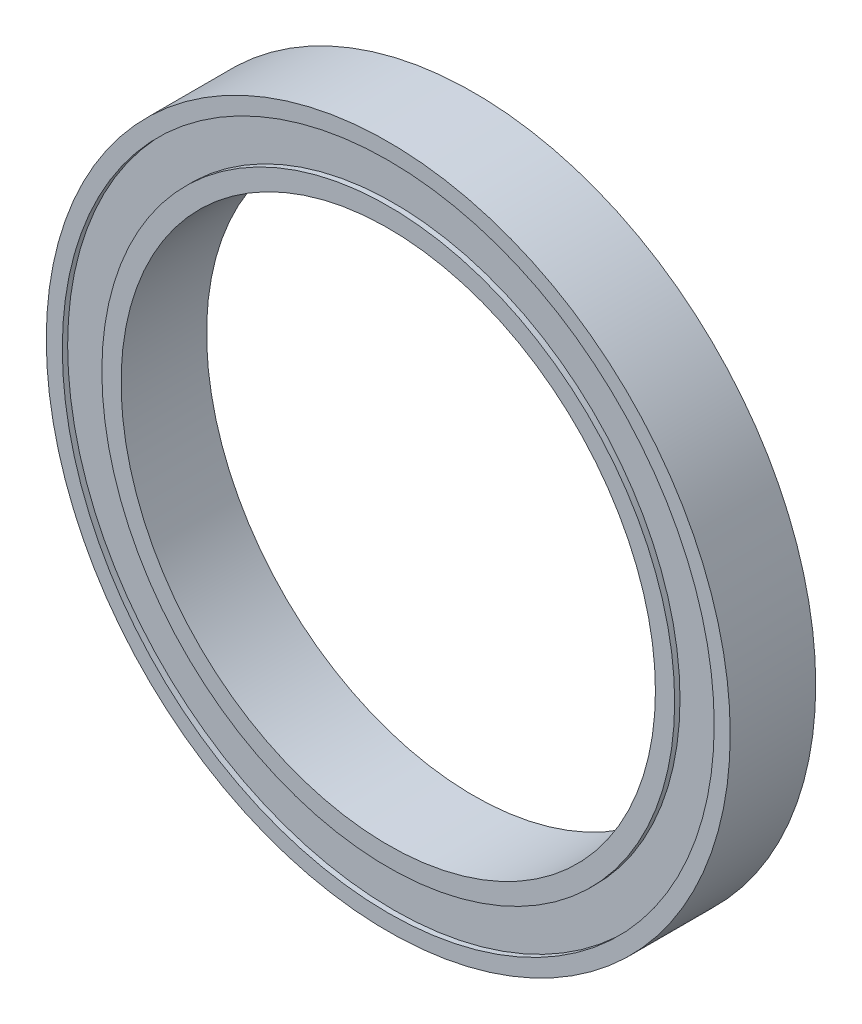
ISO-10303-21;
HEADER;
FILE_DESCRIPTION(('STEP AP214'),'2;1');
FILE_NAME('part.step','',(''),(''),'','','');
FILE_SCHEMA(('AUTOMOTIVE_DESIGN { 1 0 10303 214 1 1 1 1 }'));
ENDSEC;
DATA;
#1=APPLICATION_CONTEXT('core data for automotive mechanical design processes');
#2=APPLICATION_PROTOCOL_DEFINITION('international standard','automotive_design',2000,#1);
#3=PRODUCT_CONTEXT('',#1,'mechanical');
#4=PRODUCT('Part','Part','',(#3));
#5=PRODUCT_RELATED_PRODUCT_CATEGORY('part','',(#4));
#6=PRODUCT_DEFINITION_FORMATION('','',#4);
#7=PRODUCT_DEFINITION_CONTEXT('part definition',#1,'design');
#8=PRODUCT_DEFINITION('design','',#6,#7);
#9=PRODUCT_DEFINITION_SHAPE('','',#8);
#10=(LENGTH_UNIT() NAMED_UNIT(*) SI_UNIT(.MILLI.,.METRE.));
#11=(NAMED_UNIT(*) PLANE_ANGLE_UNIT() SI_UNIT($,.RADIAN.));
#12=(NAMED_UNIT(*) SI_UNIT($,.STERADIAN.) SOLID_ANGLE_UNIT());
#13=UNCERTAINTY_MEASURE_WITH_UNIT(LENGTH_MEASURE(1.E-05),#10,'distance_accuracy_value','');
#14=(GEOMETRIC_REPRESENTATION_CONTEXT(3) GLOBAL_UNCERTAINTY_ASSIGNED_CONTEXT((#13)) GLOBAL_UNIT_ASSIGNED_CONTEXT((#10,
#11,#12)) REPRESENTATION_CONTEXT('',''));
#15=CARTESIAN_POINT('',(0.,0.,0.));
#16=DIRECTION('',(0.,0.,1.));
#17=DIRECTION('',(1.,0.,0.));
#18=AXIS2_PLACEMENT_3D('',#15,#16,#17);
#19=CARTESIAN_POINT('',(0.,25.,0.));
#20=DIRECTION('',(0.,0.,-1.));
#21=DIRECTION('',(-1.,0.,0.));
#22=AXIS2_PLACEMENT_3D('',#19,#20,#21);
#23=PLANE('',#22);
#24=CARTESIAN_POINT('',(0.,0.,0.));
#25=DIRECTION('',(0.,0.,1.));
#26=DIRECTION('',(1.,0.,0.));
#27=AXIS2_PLACEMENT_3D('',#24,#25,#26);
#28=CIRCLE('',#27,25.);
#29=CARTESIAN_POINT('',(25.,0.,0.));
#30=VERTEX_POINT('',#29);
#31=EDGE_CURVE('E10',#30,#30,#28,.T.);
#32=ORIENTED_EDGE('',*,*,#31,.F.);
#33=EDGE_LOOP('',(#32));
#34=FACE_BOUND('',#33,.T.);
#35=CARTESIAN_POINT('',(0.,0.,0.));
#36=DIRECTION('',(0.,0.,1.));
#37=DIRECTION('',(1.,0.,0.));
#38=AXIS2_PLACEMENT_3D('',#35,#36,#37);
#39=CIRCLE('',#38,26.8);
#40=CARTESIAN_POINT('',(26.8,0.,0.));
#41=VERTEX_POINT('',#40);
#42=EDGE_CURVE('E386',#41,#41,#39,.T.);
#43=ORIENTED_EDGE('',*,*,#42,.T.);
#44=EDGE_LOOP('',(#43));
#45=FACE_BOUND('',#44,.T.);
#46=ADVANCED_FACE('F346',(#34,#45),#23,.F.);
#47=CARTESIAN_POINT('',(0.,0.,4.63572101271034));
#48=DIRECTION('',(0.,0.,1.));
#49=DIRECTION('',(1.,0.,0.));
#50=AXIS2_PLACEMENT_3D('',#47,#48,#49);
#51=CYLINDRICAL_SURFACE('',#50,25.);
#52=CARTESIAN_POINT('',(0.,0.,-8.));
#53=DIRECTION('',(0.,0.,1.));
#54=DIRECTION('',(1.,0.,0.));
#55=AXIS2_PLACEMENT_3D('',#52,#53,#54);
#56=CIRCLE('',#55,25.);
#57=CARTESIAN_POINT('',(25.,0.,-8.));
#58=VERTEX_POINT('',#57);
#59=EDGE_CURVE('E352',#58,#58,#56,.T.);
#60=ORIENTED_EDGE('',*,*,#59,.F.);
#61=EDGE_LOOP('',(#60));
#62=FACE_BOUND('',#61,.T.);
#63=ORIENTED_EDGE('',*,*,#31,.T.);
#64=EDGE_LOOP('',(#63));
#65=FACE_BOUND('',#64,.T.);
#66=ADVANCED_FACE('F447',(#62,#65),#51,.F.);
#67=CARTESIAN_POINT('',(0.,26.8,-8.));
#68=DIRECTION('',(0.,0.,1.));
#69=DIRECTION('',(1.,0.,0.));
#70=AXIS2_PLACEMENT_3D('',#67,#68,#69);
#71=PLANE('',#70);
#72=CARTESIAN_POINT('',(0.,0.,-8.));
#73=DIRECTION('',(0.,0.,1.));
#74=DIRECTION('',(1.,0.,0.));
#75=AXIS2_PLACEMENT_3D('',#72,#73,#74);
#76=CIRCLE('',#75,26.8);
#77=CARTESIAN_POINT('',(26.8,0.,-8.));
#78=VERTEX_POINT('',#77);
#79=EDGE_CURVE('E356',#78,#78,#76,.T.);
#80=ORIENTED_EDGE('',*,*,#79,.F.);
#81=EDGE_LOOP('',(#80));
#82=FACE_BOUND('',#81,.T.);
#83=ORIENTED_EDGE('',*,*,#59,.T.);
#84=EDGE_LOOP('',(#83));
#85=FACE_BOUND('',#84,.T.);
#86=ADVANCED_FACE('F442',(#82,#85),#71,.F.);
#87=CARTESIAN_POINT('',(0.,0.,4.63572101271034));
#88=DIRECTION('',(0.,0.,1.));
#89=DIRECTION('',(1.,0.,0.));
#90=AXIS2_PLACEMENT_3D('',#87,#88,#89);
#91=CYLINDRICAL_SURFACE('',#90,26.8);
#92=CARTESIAN_POINT('',(0.,0.,-7.50000000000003));
#93=DIRECTION('',(0.,0.,1.));
#94=DIRECTION('',(1.,0.,0.));
#95=AXIS2_PLACEMENT_3D('',#92,#93,#94);
#96=CIRCLE('',#95,26.8);
#97=CARTESIAN_POINT('',(26.8,0.,-7.50000000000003));
#98=VERTEX_POINT('',#97);
#99=EDGE_CURVE('E360',#98,#98,#96,.T.);
#100=ORIENTED_EDGE('',*,*,#99,.F.);
#101=EDGE_LOOP('',(#100));
#102=FACE_BOUND('',#101,.T.);
#103=ORIENTED_EDGE('',*,*,#79,.T.);
#104=EDGE_LOOP('',(#103));
#105=FACE_BOUND('',#104,.T.);
#106=ADVANCED_FACE('F436',(#102,#105),#91,.T.);
#107=CARTESIAN_POINT('',(0.,30.5,-7.50000000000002));
#108=DIRECTION('',(0.,0.,1.));
#109=DIRECTION('',(1.,0.,0.));
#110=AXIS2_PLACEMENT_3D('',#107,#108,#109);
#111=PLANE('',#110);
#112=CARTESIAN_POINT('',(0.,0.,-7.5));
#113=DIRECTION('',(0.,0.,1.));
#114=DIRECTION('',(1.,0.,0.));
#115=AXIS2_PLACEMENT_3D('',#112,#113,#114);
#116=CIRCLE('',#115,30.5);
#117=CARTESIAN_POINT('',(30.5,0.,-7.5));
#118=VERTEX_POINT('',#117);
#119=EDGE_CURVE('E365',#118,#118,#116,.T.);
#120=ORIENTED_EDGE('',*,*,#119,.F.);
#121=EDGE_LOOP('',(#120));
#122=FACE_BOUND('',#121,.T.);
#123=ORIENTED_EDGE('',*,*,#99,.T.);
#124=EDGE_LOOP('',(#123));
#125=FACE_BOUND('',#124,.T.);
#126=ADVANCED_FACE('F430',(#122,#125),#111,.F.);
#127=CARTESIAN_POINT('',(0.,0.,4.63572101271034));
#128=DIRECTION('',(0.,0.,1.));
#129=DIRECTION('',(1.,0.,0.));
#130=AXIS2_PLACEMENT_3D('',#127,#128,#129);
#131=CYLINDRICAL_SURFACE('',#130,30.5);
#132=CARTESIAN_POINT('',(0.,0.,-8.));
#133=DIRECTION('',(0.,0.,1.));
#134=DIRECTION('',(1.,0.,0.));
#135=AXIS2_PLACEMENT_3D('',#132,#133,#134);
#136=CIRCLE('',#135,30.5);
#137=CARTESIAN_POINT('',(30.5,0.,-8.));
#138=VERTEX_POINT('',#137);
#139=EDGE_CURVE('E368',#138,#138,#136,.T.);
#140=ORIENTED_EDGE('',*,*,#139,.F.);
#141=EDGE_LOOP('',(#140));
#142=FACE_BOUND('',#141,.T.);
#143=ORIENTED_EDGE('',*,*,#119,.T.);
#144=EDGE_LOOP('',(#143));
#145=FACE_BOUND('',#144,.T.);
#146=ADVANCED_FACE('F424',(#142,#145),#131,.F.);
#147=CARTESIAN_POINT('',(0.,30.5,-8.));
#148=DIRECTION('',(0.,0.,1.));
#149=DIRECTION('',(1.,0.,0.));
#150=AXIS2_PLACEMENT_3D('',#147,#148,#149);
#151=PLANE('',#150);
#152=CARTESIAN_POINT('',(0.,0.,-8.));
#153=DIRECTION('',(0.,0.,1.));
#154=DIRECTION('',(1.,0.,0.));
#155=AXIS2_PLACEMENT_3D('',#152,#153,#154);
#156=CIRCLE('',#155,32.);
#157=CARTESIAN_POINT('',(32.,0.,-8.));
#158=VERTEX_POINT('',#157);
#159=EDGE_CURVE('E371',#158,#158,#156,.T.);
#160=ORIENTED_EDGE('',*,*,#159,.F.);
#161=EDGE_LOOP('',(#160));
#162=FACE_BOUND('',#161,.T.);
#163=ORIENTED_EDGE('',*,*,#139,.T.);
#164=EDGE_LOOP('',(#163));
#165=FACE_BOUND('',#164,.T.);
#166=ADVANCED_FACE('F418',(#162,#165),#151,.F.);
#167=CARTESIAN_POINT('',(0.,0.,4.63572101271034));
#168=DIRECTION('',(0.,0.,1.));
#169=DIRECTION('',(1.,0.,0.));
#170=AXIS2_PLACEMENT_3D('',#167,#168,#169);
#171=CYLINDRICAL_SURFACE('',#170,32.);
#172=CARTESIAN_POINT('',(0.,0.,0.));
#173=DIRECTION('',(0.,0.,1.));
#174=DIRECTION('',(1.,0.,0.));
#175=AXIS2_PLACEMENT_3D('',#172,#173,#174);
#176=CIRCLE('',#175,32.);
#177=CARTESIAN_POINT('',(32.,0.,0.));
#178=VERTEX_POINT('',#177);
#179=EDGE_CURVE('E374',#178,#178,#176,.T.);
#180=ORIENTED_EDGE('',*,*,#179,.F.);
#181=EDGE_LOOP('',(#180));
#182=FACE_BOUND('',#181,.T.);
#183=ORIENTED_EDGE('',*,*,#159,.T.);
#184=EDGE_LOOP('',(#183));
#185=FACE_BOUND('',#184,.T.);
#186=ADVANCED_FACE('F412',(#182,#185),#171,.T.);
#187=CARTESIAN_POINT('',(0.,30.5,0.));
#188=DIRECTION('',(0.,0.,-1.));
#189=DIRECTION('',(-1.,0.,0.));
#190=AXIS2_PLACEMENT_3D('',#187,#188,#189);
#191=PLANE('',#190);
#192=CARTESIAN_POINT('',(0.,0.,0.));
#193=DIRECTION('',(0.,0.,1.));
#194=DIRECTION('',(1.,0.,0.));
#195=AXIS2_PLACEMENT_3D('',#192,#193,#194);
#196=CIRCLE('',#195,30.5);
#197=CARTESIAN_POINT('',(30.5,0.,0.));
#198=VERTEX_POINT('',#197);
#199=EDGE_CURVE('E377',#198,#198,#196,.T.);
#200=ORIENTED_EDGE('',*,*,#199,.F.);
#201=EDGE_LOOP('',(#200));
#202=FACE_BOUND('',#201,.T.);
#203=ORIENTED_EDGE('',*,*,#179,.T.);
#204=EDGE_LOOP('',(#203));
#205=FACE_BOUND('',#204,.T.);
#206=ADVANCED_FACE('F406',(#202,#205),#191,.F.);
#207=CARTESIAN_POINT('',(0.,0.,4.63572101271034));
#208=DIRECTION('',(0.,0.,1.));
#209=DIRECTION('',(1.,0.,0.));
#210=AXIS2_PLACEMENT_3D('',#207,#208,#209);
#211=CYLINDRICAL_SURFACE('',#210,30.5);
#212=CARTESIAN_POINT('',(0.,0.,-0.500000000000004));
#213=DIRECTION('',(0.,0.,1.));
#214=DIRECTION('',(1.,0.,0.));
#215=AXIS2_PLACEMENT_3D('',#212,#213,#214);
#216=CIRCLE('',#215,30.5);
#217=CARTESIAN_POINT('',(30.5,0.,-0.500000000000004));
#218=VERTEX_POINT('',#217);
#219=EDGE_CURVE('E380',#218,#218,#216,.T.);
#220=ORIENTED_EDGE('',*,*,#219,.F.);
#221=EDGE_LOOP('',(#220));
#222=FACE_BOUND('',#221,.T.);
#223=ORIENTED_EDGE('',*,*,#199,.T.);
#224=EDGE_LOOP('',(#223));
#225=FACE_BOUND('',#224,.T.);
#226=ADVANCED_FACE('F400',(#222,#225),#211,.F.);
#227=CARTESIAN_POINT('',(0.,30.5,-0.500000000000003));
#228=DIRECTION('',(0.,0.,-1.));
#229=DIRECTION('',(-1.,0.,0.));
#230=AXIS2_PLACEMENT_3D('',#227,#228,#229);
#231=PLANE('',#230);
#232=CARTESIAN_POINT('',(0.,0.,-0.500000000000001));
#233=DIRECTION('',(0.,0.,1.));
#234=DIRECTION('',(1.,0.,0.));
#235=AXIS2_PLACEMENT_3D('',#232,#233,#234);
#236=CIRCLE('',#235,26.8);
#237=CARTESIAN_POINT('',(26.8,0.,-0.500000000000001));
#238=VERTEX_POINT('',#237);
#239=EDGE_CURVE('E383',#238,#238,#236,.T.);
#240=ORIENTED_EDGE('',*,*,#239,.F.);
#241=EDGE_LOOP('',(#240));
#242=FACE_BOUND('',#241,.T.);
#243=ORIENTED_EDGE('',*,*,#219,.T.);
#244=EDGE_LOOP('',(#243));
#245=FACE_BOUND('',#244,.T.);
#246=ADVANCED_FACE('F394',(#242,#245),#231,.F.);
#247=CARTESIAN_POINT('',(0.,0.,4.63572101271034));
#248=DIRECTION('',(0.,0.,1.));
#249=DIRECTION('',(1.,0.,0.));
#250=AXIS2_PLACEMENT_3D('',#247,#248,#249);
#251=CYLINDRICAL_SURFACE('',#250,26.8);
#252=ORIENTED_EDGE('',*,*,#42,.F.);
#253=EDGE_LOOP('',(#252));
#254=FACE_BOUND('',#253,.T.);
#255=ORIENTED_EDGE('',*,*,#239,.T.);
#256=EDGE_LOOP('',(#255));
#257=FACE_BOUND('',#256,.T.);
#258=ADVANCED_FACE('F391',(#254,#257),#251,.T.);
#259=CLOSED_SHELL('',(#46,#66,#86,#106,#126,#146,#166,#186,#206,#226,#246,#258));
#260=MANIFOLD_SOLID_BREP('B2',#259);
#261=ADVANCED_BREP_SHAPE_REPRESENTATION('',(#18,#260),#14);
#262=SHAPE_DEFINITION_REPRESENTATION(#9,#261);
ENDSEC;
END-ISO-10303-21;
